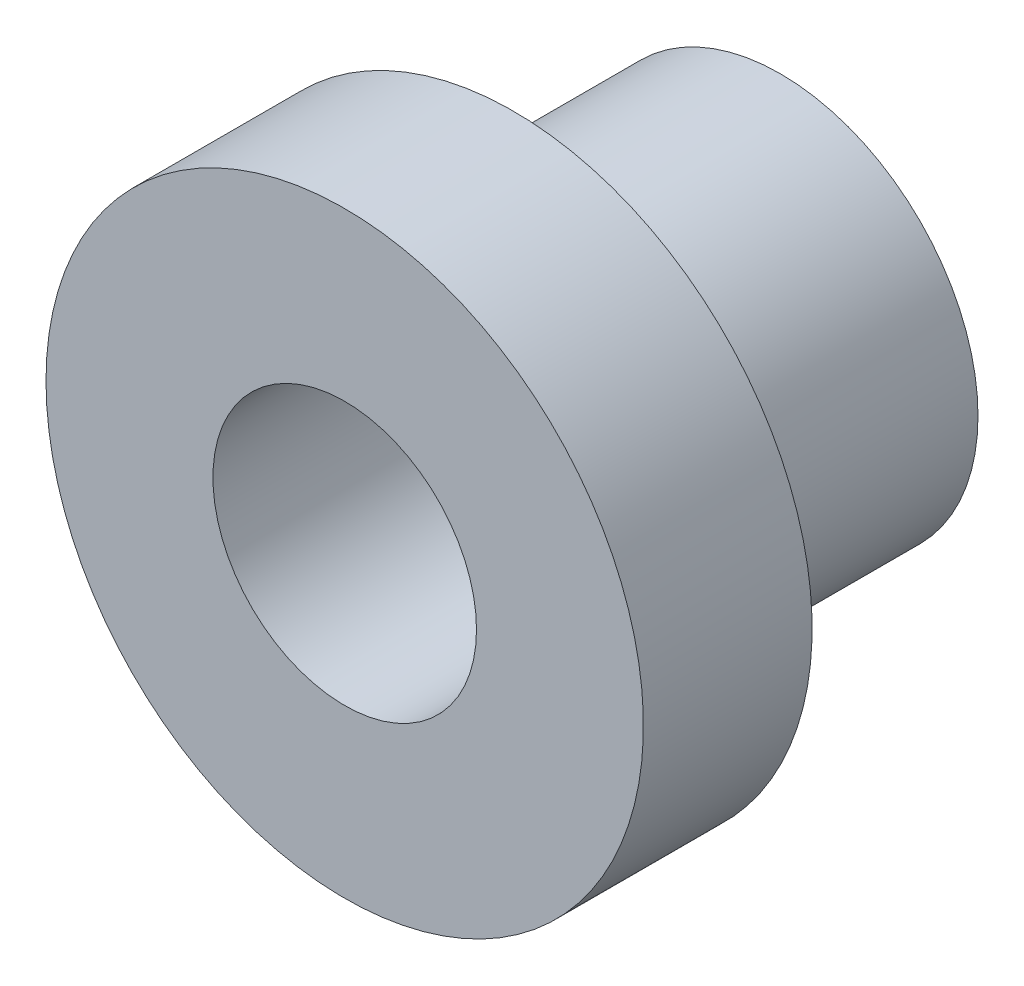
from build123d import *

# Parameters (mm, degrees)
SKETCH1_R          = 10.795
EXTRUDE1_DEPTH     = 6.096
SKETCH2_R          = 7.1374
EXTRUDE2_DEPTH     = 9.652
SKETCH3_R          = 4.7625
CUT_EXTRUDE1_DEPTH = 22.933161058


with BuildPart() as part:
    # Sketch1 → Extrude1 (new body)
    with BuildSketch(Plane.XY):
        with Locations(Location((0, 0, 0), (0, 0, 180))):
            Circle(SKETCH1_R)
    extrude(amount=EXTRUDE1_DEPTH)

    # Sketch2 → Extrude2 (add)
    with BuildSketch(Plane(origin=(0, 0, 0), x_dir=(-1, 0, 0), z_dir=(0, 0, -1))):
        with Locations(Location((0, 0, 0), (0, 0, 180))):
            Circle(SKETCH2_R)
    extrude(amount=EXTRUDE2_DEPTH)

    # Sketch3 → Cut-Extrude1 (cut, through all)
    with BuildSketch(Plane.XY.offset(6.096)):
        Circle(SKETCH3_R)
    extrude(amount=-CUT_EXTRUDE1_DEPTH, mode=Mode.SUBTRACT)


solid = part.part
